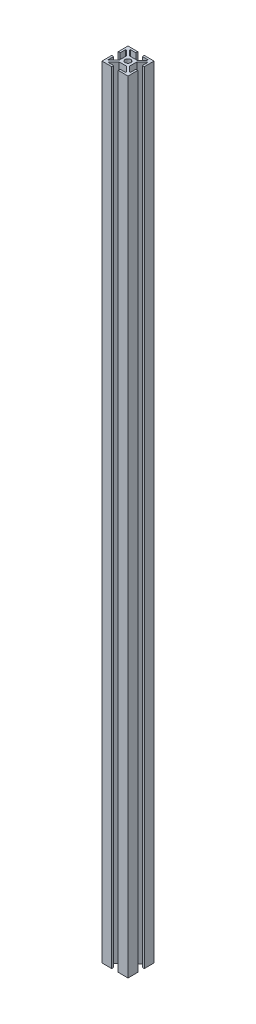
ISO-10303-21;
HEADER;
FILE_DESCRIPTION(('STEP AP214'),'2;1');
FILE_NAME('part.step','',(''),(''),'','','');
FILE_SCHEMA(('AUTOMOTIVE_DESIGN { 1 0 10303 214 1 1 1 1 }'));
ENDSEC;
DATA;
#1=APPLICATION_CONTEXT('core data for automotive mechanical design processes');
#2=APPLICATION_PROTOCOL_DEFINITION('international standard','automotive_design',2000,#1);
#3=PRODUCT_CONTEXT('',#1,'mechanical');
#4=PRODUCT('Part','Part','',(#3));
#5=PRODUCT_RELATED_PRODUCT_CATEGORY('part','',(#4));
#6=PRODUCT_DEFINITION_FORMATION('','',#4);
#7=PRODUCT_DEFINITION_CONTEXT('part definition',#1,'design');
#8=PRODUCT_DEFINITION('design','',#6,#7);
#9=PRODUCT_DEFINITION_SHAPE('','',#8);
#10=(LENGTH_UNIT() NAMED_UNIT(*) SI_UNIT(.MILLI.,.METRE.));
#11=(NAMED_UNIT(*) PLANE_ANGLE_UNIT() SI_UNIT($,.RADIAN.));
#12=(NAMED_UNIT(*) SI_UNIT($,.STERADIAN.) SOLID_ANGLE_UNIT());
#13=UNCERTAINTY_MEASURE_WITH_UNIT(LENGTH_MEASURE(1.E-05),#10,'distance_accuracy_value','');
#14=(GEOMETRIC_REPRESENTATION_CONTEXT(3) GLOBAL_UNCERTAINTY_ASSIGNED_CONTEXT((#13)) GLOBAL_UNIT_ASSIGNED_CONTEXT((#10,
#11,#12)) REPRESENTATION_CONTEXT('',''));
#15=CARTESIAN_POINT('',(0.,0.,0.));
#16=DIRECTION('',(0.,0.,1.));
#17=DIRECTION('',(1.,0.,0.));
#18=AXIS2_PLACEMENT_3D('',#15,#16,#17);
#19=CARTESIAN_POINT('',(0.,600.,0.));
#20=DIRECTION('',(0.,-1.,0.));
#21=DIRECTION('',(0.,0.,-1.));
#22=AXIS2_PLACEMENT_3D('',#19,#20,#21);
#23=PLANE('',#22);
#24=DIRECTION('',(0.,0.,1.));
#25=VECTOR('',#24,1.);
#26=CARTESIAN_POINT('',(-10.,600.,-10.));
#27=LINE('',#26,#25);
#28=CARTESIAN_POINT('',(-10.,600.,-10.));
#29=VERTEX_POINT('',#28);
#30=CARTESIAN_POINT('',(-10.,600.,-2.49999999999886));
#31=VERTEX_POINT('',#30);
#32=EDGE_CURVE('E437',#29,#31,#27,.T.);
#33=ORIENTED_EDGE('',*,*,#32,.T.);
#34=DIRECTION('',(1.,0.,0.));
#35=VECTOR('',#34,1.);
#36=CARTESIAN_POINT('',(-8.49999999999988,600.,-2.49999999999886));
#37=LINE('',#36,#35);
#38=CARTESIAN_POINT('',(-8.49999999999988,600.,-2.49999999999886));
#39=VERTEX_POINT('',#38);
#40=EDGE_CURVE('E205',#31,#39,#37,.T.);
#41=ORIENTED_EDGE('',*,*,#40,.T.);
#42=DIRECTION('',(1.87350135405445E-13,0.,-1.));
#43=VECTOR('',#42,1.);
#44=CARTESIAN_POINT('',(-8.49999999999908,600.,-6.75));
#45=LINE('',#44,#43);
#46=CARTESIAN_POINT('',(-8.49999999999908,600.,-6.75));
#47=VERTEX_POINT('',#46);
#48=EDGE_CURVE('E560',#39,#47,#45,.T.);
#49=ORIENTED_EDGE('',*,*,#48,.T.);
#50=DIRECTION('',(1.,0.,0.));
#51=VECTOR('',#50,1.);
#52=CARTESIAN_POINT('',(-7.84616907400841,600.,-6.75));
#53=LINE('',#52,#51);
#54=CARTESIAN_POINT('',(-7.84616907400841,600.,-6.75));
#55=VERTEX_POINT('',#54);
#56=EDGE_CURVE('E579',#47,#55,#53,.T.);
#57=ORIENTED_EDGE('',*,*,#56,.T.);
#58=DIRECTION('',(0.707106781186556,0.,0.707106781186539));
#59=VECTOR('',#58,1.);
#60=CARTESIAN_POINT('',(-4.00000000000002,600.,-2.9038309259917));
#61=LINE('',#60,#59);
#62=CARTESIAN_POINT('',(-4.00000000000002,600.,-2.9038309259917));
#63=VERTEX_POINT('',#62);
#64=EDGE_CURVE('E576',#55,#63,#61,.T.);
#65=ORIENTED_EDGE('',*,*,#64,.T.);
#66=DIRECTION('',(0.,0.,1.));
#67=VECTOR('',#66,1.);
#68=CARTESIAN_POINT('',(-4.00000000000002,600.,-2.9038309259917));
#69=LINE('',#68,#67);
#70=CARTESIAN_POINT('',(-4.00000000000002,600.,2.9038309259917));
#71=VERTEX_POINT('',#70);
#72=EDGE_CURVE('E578',#63,#71,#69,.T.);
#73=ORIENTED_EDGE('',*,*,#72,.T.);
#74=DIRECTION('',(-0.707106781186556,0.,0.707106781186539));
#75=VECTOR('',#74,1.);
#76=CARTESIAN_POINT('',(-4.00000000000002,600.,2.9038309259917));
#77=LINE('',#76,#75);
#78=CARTESIAN_POINT('',(-7.84616907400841,600.,6.75));
#79=VERTEX_POINT('',#78);
#80=EDGE_CURVE('E581',#71,#79,#77,.T.);
#81=ORIENTED_EDGE('',*,*,#80,.T.);
#82=DIRECTION('',(-1.,0.,0.));
#83=VECTOR('',#82,1.);
#84=CARTESIAN_POINT('',(-7.84616907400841,600.,6.75));
#85=LINE('',#84,#83);
#86=CARTESIAN_POINT('',(-8.49999999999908,600.,6.75));
#87=VERTEX_POINT('',#86);
#88=EDGE_CURVE('E587',#79,#87,#85,.T.);
#89=ORIENTED_EDGE('',*,*,#88,.T.);
#90=DIRECTION('',(-1.87350135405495E-13,0.,-1.));
#91=VECTOR('',#90,1.);
#92=CARTESIAN_POINT('',(-8.49999999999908,600.,6.75));
#93=LINE('',#92,#91);
#94=CARTESIAN_POINT('',(-8.49999999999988,600.,2.5));
#95=VERTEX_POINT('',#94);
#96=EDGE_CURVE('E589',#87,#95,#93,.T.);
#97=ORIENTED_EDGE('',*,*,#96,.T.);
#98=DIRECTION('',(-1.,0.,0.));
#99=VECTOR('',#98,1.);
#100=CARTESIAN_POINT('',(-8.49999999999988,600.,2.5));
#101=LINE('',#100,#99);
#102=CARTESIAN_POINT('',(-10.,600.,2.5));
#103=VERTEX_POINT('',#102);
#104=EDGE_CURVE('E591',#95,#103,#101,.T.);
#105=ORIENTED_EDGE('',*,*,#104,.T.);
#106=DIRECTION('',(0.,0.,1.));
#107=VECTOR('',#106,1.);
#108=CARTESIAN_POINT('',(-10.,600.,2.5));
#109=LINE('',#108,#107);
#110=CARTESIAN_POINT('',(-10.,600.,10.));
#111=VERTEX_POINT('',#110);
#112=EDGE_CURVE('E593',#103,#111,#109,.T.);
#113=ORIENTED_EDGE('',*,*,#112,.T.);
#114=DIRECTION('',(1.,0.,-6.06459327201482E-13));
#115=VECTOR('',#114,1.);
#116=CARTESIAN_POINT('',(-10.,600.,10.));
#117=LINE('',#116,#115);
#118=CARTESIAN_POINT('',(-2.49999999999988,600.,9.99999999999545));
#119=VERTEX_POINT('',#118);
#120=EDGE_CURVE('E595',#111,#119,#117,.T.);
#121=ORIENTED_EDGE('',*,*,#120,.T.);
#122=DIRECTION('',(0.,0.,-1.));
#123=VECTOR('',#122,1.);
#124=CARTESIAN_POINT('',(-2.49999999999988,600.,9.99999999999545));
#125=LINE('',#124,#123);
#126=CARTESIAN_POINT('',(-2.49999999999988,600.,8.49999999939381));
#127=VERTEX_POINT('',#126);
#128=EDGE_CURVE('E597',#119,#127,#125,.T.);
#129=ORIENTED_EDGE('',*,*,#128,.T.);
#130=DIRECTION('',(-1.,0.,0.));
#131=VECTOR('',#130,1.);
#132=CARTESIAN_POINT('',(-2.49999999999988,600.,8.49999999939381));
#133=LINE('',#132,#131);
#134=CARTESIAN_POINT('',(-6.75000000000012,600.,8.49999999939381));
#135=VERTEX_POINT('',#134);
#136=EDGE_CURVE('E599',#127,#135,#133,.T.);
#137=ORIENTED_EDGE('',*,*,#136,.T.);
#138=DIRECTION('',(4.9623445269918E-12,0.,-1.));
#139=VECTOR('',#138,1.);
#140=CARTESIAN_POINT('',(-6.74999999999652,600.,7.7751512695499));
#141=LINE('',#140,#139);
#142=CARTESIAN_POINT('',(-6.74999999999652,600.,7.7751512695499));
#143=VERTEX_POINT('',#142);
#144=EDGE_CURVE('E601',#135,#143,#141,.T.);
#145=ORIENTED_EDGE('',*,*,#144,.T.);
#146=DIRECTION('',(0.707106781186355,0.,-0.70710678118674));
#147=VECTOR('',#146,1.);
#148=CARTESIAN_POINT('',(-2.97484873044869,600.,4.));
#149=LINE('',#148,#147);
#150=CARTESIAN_POINT('',(-2.97484873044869,600.,4.));
#151=VERTEX_POINT('',#150);
#152=EDGE_CURVE('E603',#143,#151,#149,.T.);
#153=ORIENTED_EDGE('',*,*,#152,.T.);
#154=DIRECTION('',(1.,0.,0.));
#155=VECTOR('',#154,1.);
#156=CARTESIAN_POINT('',(-2.97484873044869,600.,4.));
#157=LINE('',#156,#155);
#158=CARTESIAN_POINT('',(2.97484873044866,600.,4.));
#159=VERTEX_POINT('',#158);
#160=EDGE_CURVE('E605',#151,#159,#157,.T.);
#161=ORIENTED_EDGE('',*,*,#160,.T.);
#162=DIRECTION('',(0.707106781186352,0.,0.707106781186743));
#163=VECTOR('',#162,1.);
#164=CARTESIAN_POINT('',(2.97484873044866,600.,4.));
#165=LINE('',#164,#163);
#166=CARTESIAN_POINT('',(6.74999999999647,600.,7.7751512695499));
#167=VERTEX_POINT('',#166);
#168=EDGE_CURVE('E607',#159,#167,#165,.T.);
#169=ORIENTED_EDGE('',*,*,#168,.T.);
#170=DIRECTION('',(5.03892761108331E-12,0.,1.));
#171=VECTOR('',#170,1.);
#172=CARTESIAN_POINT('',(6.74999999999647,600.,7.7751512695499));
#173=LINE('',#172,#171);
#174=CARTESIAN_POINT('',(6.75000000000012,600.,8.49999999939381));
#175=VERTEX_POINT('',#174);
#176=EDGE_CURVE('E609',#167,#175,#173,.T.);
#177=ORIENTED_EDGE('',*,*,#176,.T.);
#178=DIRECTION('',(-1.,0.,0.));
#179=VECTOR('',#178,1.);
#180=CARTESIAN_POINT('',(2.50000000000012,600.,8.49999999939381));
#181=LINE('',#180,#179);
#182=CARTESIAN_POINT('',(2.50000000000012,600.,8.49999999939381));
#183=VERTEX_POINT('',#182);
#184=EDGE_CURVE('E611',#175,#183,#181,.T.);
#185=ORIENTED_EDGE('',*,*,#184,.T.);
#186=DIRECTION('',(0.,0.,1.));
#187=VECTOR('',#186,1.);
#188=CARTESIAN_POINT('',(2.50000000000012,600.,9.99999999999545));
#189=LINE('',#188,#187);
#190=CARTESIAN_POINT('',(2.50000000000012,600.,9.99999999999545));
#191=VERTEX_POINT('',#190);
#192=EDGE_CURVE('E613',#183,#191,#189,.T.);
#193=ORIENTED_EDGE('',*,*,#192,.T.);
#194=DIRECTION('',(1.,0.,6.06459327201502E-13));
#195=VECTOR('',#194,1.);
#196=CARTESIAN_POINT('',(2.50000000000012,600.,9.99999999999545));
#197=LINE('',#196,#195);
#198=CARTESIAN_POINT('',(10.,600.,10.));
#199=VERTEX_POINT('',#198);
#200=EDGE_CURVE('E615',#191,#199,#197,.T.);
#201=ORIENTED_EDGE('',*,*,#200,.T.);
#202=DIRECTION('',(0.,0.,-1.));
#203=VECTOR('',#202,1.);
#204=CARTESIAN_POINT('',(10.,600.,2.5));
#205=LINE('',#204,#203);
#206=CARTESIAN_POINT('',(10.,600.,2.5));
#207=VERTEX_POINT('',#206);
#208=EDGE_CURVE('E617',#199,#207,#205,.T.);
#209=ORIENTED_EDGE('',*,*,#208,.T.);
#210=DIRECTION('',(-1.,0.,0.));
#211=VECTOR('',#210,1.);
#212=CARTESIAN_POINT('',(8.50000000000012,600.,2.5));
#213=LINE('',#212,#211);
#214=CARTESIAN_POINT('',(8.50000000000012,600.,2.5));
#215=VERTEX_POINT('',#214);
#216=EDGE_CURVE('E619',#207,#215,#213,.T.);
#217=ORIENTED_EDGE('',*,*,#216,.T.);
#218=DIRECTION('',(-2.55106393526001E-13,0.,1.));
#219=VECTOR('',#218,1.);
#220=CARTESIAN_POINT('',(8.49999999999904,600.,6.75));
#221=LINE('',#220,#219);
#222=CARTESIAN_POINT('',(8.49999999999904,600.,6.75));
#223=VERTEX_POINT('',#222);
#224=EDGE_CURVE('E621',#215,#223,#221,.T.);
#225=ORIENTED_EDGE('',*,*,#224,.T.);
#226=DIRECTION('',(-1.,0.,0.));
#227=VECTOR('',#226,1.);
#228=CARTESIAN_POINT('',(7.84616907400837,600.,6.75));
#229=LINE('',#228,#227);
#230=CARTESIAN_POINT('',(7.84616907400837,600.,6.75));
#231=VERTEX_POINT('',#230);
#232=EDGE_CURVE('E623',#223,#231,#229,.T.);
#233=ORIENTED_EDGE('',*,*,#232,.T.);
#234=DIRECTION('',(-0.707106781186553,0.,-0.707106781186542));
#235=VECTOR('',#234,1.);
#236=CARTESIAN_POINT('',(4.,600.,2.9038309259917));
#237=LINE('',#236,#235);
#238=CARTESIAN_POINT('',(4.,600.,2.9038309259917));
#239=VERTEX_POINT('',#238);
#240=EDGE_CURVE('E625',#231,#239,#237,.T.);
#241=ORIENTED_EDGE('',*,*,#240,.T.);
#242=DIRECTION('',(0.,0.,-1.));
#243=VECTOR('',#242,1.);
#244=CARTESIAN_POINT('',(4.,600.,-2.9038309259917));
#245=LINE('',#244,#243);
#246=CARTESIAN_POINT('',(4.,600.,-2.9038309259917));
#247=VERTEX_POINT('',#246);
#248=EDGE_CURVE('E627',#239,#247,#245,.T.);
#249=ORIENTED_EDGE('',*,*,#248,.T.);
#250=DIRECTION('',(0.707106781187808,0.,-0.707106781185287));
#251=VECTOR('',#250,1.);
#252=CARTESIAN_POINT('',(4.,600.,-2.9038309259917));
#253=LINE('',#252,#251);
#254=CARTESIAN_POINT('',(7.84616907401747,600.,-6.74999999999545));
#255=VERTEX_POINT('',#254);
#256=EDGE_CURVE('E629',#247,#255,#253,.T.);
#257=ORIENTED_EDGE('',*,*,#256,.T.);
#258=DIRECTION('',(1.,0.,-6.95660724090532E-12));
#259=VECTOR('',#258,1.);
#260=CARTESIAN_POINT('',(7.84616907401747,600.,-6.74999999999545));
#261=LINE('',#260,#259);
#262=CARTESIAN_POINT('',(8.49999999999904,600.,-6.75));
#263=VERTEX_POINT('',#262);
#264=EDGE_CURVE('E631',#255,#263,#261,.T.);
#265=ORIENTED_EDGE('',*,*,#264,.T.);
#266=DIRECTION('',(2.55106393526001E-13,0.,1.));
#267=VECTOR('',#266,1.);
#268=CARTESIAN_POINT('',(8.49999999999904,600.,-6.75));
#269=LINE('',#268,#267);
#270=CARTESIAN_POINT('',(8.50000000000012,600.,-2.5));
#271=VERTEX_POINT('',#270);
#272=EDGE_CURVE('E633',#263,#271,#269,.T.);
#273=ORIENTED_EDGE('',*,*,#272,.T.);
#274=DIRECTION('',(1.,0.,0.));
#275=VECTOR('',#274,1.);
#276=CARTESIAN_POINT('',(8.50000000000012,600.,-2.5));
#277=LINE('',#276,#275);
#278=CARTESIAN_POINT('',(10.,600.,-2.5));
#279=VERTEX_POINT('',#278);
#280=EDGE_CURVE('E635',#271,#279,#277,.T.);
#281=ORIENTED_EDGE('',*,*,#280,.T.);
#282=DIRECTION('',(0.,0.,-1.));
#283=VECTOR('',#282,1.);
#284=CARTESIAN_POINT('',(10.,600.,-10.));
#285=LINE('',#284,#283);
#286=CARTESIAN_POINT('',(10.,600.,-10.));
#287=VERTEX_POINT('',#286);
#288=EDGE_CURVE('E637',#279,#287,#285,.T.);
#289=ORIENTED_EDGE('',*,*,#288,.T.);
#290=DIRECTION('',(-1.,0.,6.06228030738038E-13));
#291=VECTOR('',#290,1.);
#292=CARTESIAN_POINT('',(2.50000000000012,600.,-9.99999999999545));
#293=LINE('',#292,#291);
#294=CARTESIAN_POINT('',(2.50000000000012,600.,-9.99999999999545));
#295=VERTEX_POINT('',#294);
#296=EDGE_CURVE('E639',#287,#295,#293,.T.);
#297=ORIENTED_EDGE('',*,*,#296,.T.);
#298=DIRECTION('',(0.,0.,1.));
#299=VECTOR('',#298,1.);
#300=CARTESIAN_POINT('',(2.50000000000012,600.,-9.99999999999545));
#301=LINE('',#300,#299);
#302=CARTESIAN_POINT('',(2.50000000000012,600.,-8.49999999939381));
#303=VERTEX_POINT('',#302);
#304=EDGE_CURVE('E641',#295,#303,#301,.T.);
#305=ORIENTED_EDGE('',*,*,#304,.T.);
#306=DIRECTION('',(1.,0.,0.));
#307=VECTOR('',#306,1.);
#308=CARTESIAN_POINT('',(2.50000000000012,600.,-8.49999999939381));
#309=LINE('',#308,#307);
#310=CARTESIAN_POINT('',(6.75000000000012,600.,-8.49999999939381));
#311=VERTEX_POINT('',#310);
#312=EDGE_CURVE('E643',#303,#311,#309,.T.);
#313=ORIENTED_EDGE('',*,*,#312,.T.);
#314=DIRECTION('',(-1.68722107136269E-13,0.,1.));
#315=VECTOR('',#314,1.);
#316=CARTESIAN_POINT('',(6.75,600.,-7.77515126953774));
#317=LINE('',#316,#315);
#318=CARTESIAN_POINT('',(6.75,600.,-7.77515126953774));
#319=VERTEX_POINT('',#318);
#320=EDGE_CURVE('E645',#311,#319,#317,.T.);
#321=ORIENTED_EDGE('',*,*,#320,.T.);
#322=DIRECTION('',(-0.707106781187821,0.,0.707106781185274));
#323=VECTOR('',#322,1.);
#324=CARTESIAN_POINT('',(2.97484873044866,600.,-4.));
#325=LINE('',#324,#323);
#326=CARTESIAN_POINT('',(2.97484873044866,600.,-4.));
#327=VERTEX_POINT('',#326);
#328=EDGE_CURVE('E647',#319,#327,#325,.T.);
#329=ORIENTED_EDGE('',*,*,#328,.T.);
#330=DIRECTION('',(-1.,0.,0.));
#331=VECTOR('',#330,1.);
#332=CARTESIAN_POINT('',(-2.97484873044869,600.,-4.));
#333=LINE('',#332,#331);
#334=CARTESIAN_POINT('',(-2.97484873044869,600.,-4.));
#335=VERTEX_POINT('',#334);
#336=EDGE_CURVE('E649',#327,#335,#333,.T.);
#337=ORIENTED_EDGE('',*,*,#336,.T.);
#338=DIRECTION('',(-0.707106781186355,0.,-0.70710678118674));
#339=VECTOR('',#338,1.);
#340=CARTESIAN_POINT('',(-2.97484873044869,600.,-4.));
#341=LINE('',#340,#339);
#342=CARTESIAN_POINT('',(-6.74999999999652,600.,-7.7751512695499));
#343=VERTEX_POINT('',#342);
#344=EDGE_CURVE('E651',#335,#343,#341,.T.);
#345=ORIENTED_EDGE('',*,*,#344,.T.);
#346=DIRECTION('',(-4.9623445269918E-12,0.,-1.));
#347=VECTOR('',#346,1.);
#348=CARTESIAN_POINT('',(-6.74999999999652,600.,-7.7751512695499));
#349=LINE('',#348,#347);
#350=CARTESIAN_POINT('',(-6.75000000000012,600.,-8.49999999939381));
#351=VERTEX_POINT('',#350);
#352=EDGE_CURVE('E332',#343,#351,#349,.T.);
#353=ORIENTED_EDGE('',*,*,#352,.T.);
#354=DIRECTION('',(1.,0.,0.));
#355=VECTOR('',#354,1.);
#356=CARTESIAN_POINT('',(-2.49999999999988,600.,-8.49999999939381));
#357=LINE('',#356,#355);
#358=CARTESIAN_POINT('',(-2.49999999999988,600.,-8.49999999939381));
#359=VERTEX_POINT('',#358);
#360=EDGE_CURVE('E326',#351,#359,#357,.T.);
#361=ORIENTED_EDGE('',*,*,#360,.T.);
#362=DIRECTION('',(0.,0.,-1.));
#363=VECTOR('',#362,1.);
#364=CARTESIAN_POINT('',(-2.49999999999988,600.,-10.));
#365=LINE('',#364,#363);
#366=CARTESIAN_POINT('',(-2.49999999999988,600.,-10.));
#367=VERTEX_POINT('',#366);
#368=EDGE_CURVE('E330',#359,#367,#365,.T.);
#369=ORIENTED_EDGE('',*,*,#368,.T.);
#370=DIRECTION('',(-1.,0.,0.));
#371=VECTOR('',#370,1.);
#372=CARTESIAN_POINT('',(-10.,600.,-10.));
#373=LINE('',#372,#371);
#374=EDGE_CURVE('E54',#367,#29,#373,.T.);
#375=ORIENTED_EDGE('',*,*,#374,.T.);
#376=EDGE_LOOP('',(#33,#41,#49,#57,#65,#73,#81,#89,#97,#105,#113,#121,#129,#137,#145,#153,#161,
#169,#177,#185,#193,#201,#209,#217,#225,#233,#241,#249,#257,#265,#273,#281,#289,#297,#305,#313,
#321,#329,#337,#345,#353,#361,#369,#375));
#377=FACE_BOUND('',#376,.T.);
#378=CARTESIAN_POINT('',(0.,600.,0.));
#379=DIRECTION('',(0.,1.,0.));
#380=DIRECTION('',(0.,0.,1.));
#381=AXIS2_PLACEMENT_3D('',#378,#379,#380);
#382=CIRCLE('',#381,2.15);
#383=CARTESIAN_POINT('',(0.,600.,2.15));
#384=VERTEX_POINT('',#383);
#385=EDGE_CURVE('E354',#384,#384,#382,.T.);
#386=ORIENTED_EDGE('',*,*,#385,.F.);
#387=EDGE_LOOP('',(#386));
#388=FACE_BOUND('',#387,.T.);
#389=ADVANCED_FACE('F37',(#377,#388),#23,.F.);
#390=CARTESIAN_POINT('',(0.,0.,0.));
#391=DIRECTION('',(0.,-1.,0.));
#392=DIRECTION('',(0.,0.,-1.));
#393=AXIS2_PLACEMENT_3D('',#390,#391,#392);
#394=PLANE('',#393);
#395=DIRECTION('',(0.,0.,1.));
#396=VECTOR('',#395,1.);
#397=CARTESIAN_POINT('',(-10.,0.,-10.));
#398=LINE('',#397,#396);
#399=CARTESIAN_POINT('',(-10.,0.,-10.));
#400=VERTEX_POINT('',#399);
#401=CARTESIAN_POINT('',(-10.,0.,-2.49999999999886));
#402=VERTEX_POINT('',#401);
#403=EDGE_CURVE('E350',#400,#402,#398,.T.);
#404=ORIENTED_EDGE('',*,*,#403,.F.);
#405=DIRECTION('',(-1.,0.,0.));
#406=VECTOR('',#405,1.);
#407=CARTESIAN_POINT('',(-10.,0.,-10.));
#408=LINE('',#407,#406);
#409=CARTESIAN_POINT('',(-2.49999999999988,0.,-10.));
#410=VERTEX_POINT('',#409);
#411=EDGE_CURVE('E197',#410,#400,#408,.T.);
#412=ORIENTED_EDGE('',*,*,#411,.F.);
#413=DIRECTION('',(0.,0.,-1.));
#414=VECTOR('',#413,1.);
#415=CARTESIAN_POINT('',(-2.49999999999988,0.,-10.));
#416=LINE('',#415,#414);
#417=CARTESIAN_POINT('',(-2.49999999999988,0.,-8.49999999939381));
#418=VERTEX_POINT('',#417);
#419=EDGE_CURVE('E191',#418,#410,#416,.T.);
#420=ORIENTED_EDGE('',*,*,#419,.F.);
#421=DIRECTION('',(1.,0.,0.));
#422=VECTOR('',#421,1.);
#423=CARTESIAN_POINT('',(-2.49999999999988,0.,-8.49999999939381));
#424=LINE('',#423,#422);
#425=CARTESIAN_POINT('',(-6.75000000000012,0.,-8.49999999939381));
#426=VERTEX_POINT('',#425);
#427=EDGE_CURVE('E340',#426,#418,#424,.T.);
#428=ORIENTED_EDGE('',*,*,#427,.F.);
#429=DIRECTION('',(-4.9623445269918E-12,0.,-1.));
#430=VECTOR('',#429,1.);
#431=CARTESIAN_POINT('',(-6.74999999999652,0.,-7.7751512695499));
#432=LINE('',#431,#430);
#433=CARTESIAN_POINT('',(-6.74999999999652,0.,-7.7751512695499));
#434=VERTEX_POINT('',#433);
#435=EDGE_CURVE('E432',#434,#426,#432,.T.);
#436=ORIENTED_EDGE('',*,*,#435,.F.);
#437=DIRECTION('',(-0.707106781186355,0.,-0.70710678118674));
#438=VECTOR('',#437,1.);
#439=CARTESIAN_POINT('',(-2.97484873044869,0.,-4.));
#440=LINE('',#439,#438);
#441=CARTESIAN_POINT('',(-2.97484873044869,0.,-4.));
#442=VERTEX_POINT('',#441);
#443=EDGE_CURVE('E430',#442,#434,#440,.T.);
#444=ORIENTED_EDGE('',*,*,#443,.F.);
#445=DIRECTION('',(-1.,0.,0.));
#446=VECTOR('',#445,1.);
#447=CARTESIAN_POINT('',(-2.97484873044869,0.,-4.));
#448=LINE('',#447,#446);
#449=CARTESIAN_POINT('',(2.97484873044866,0.,-4.));
#450=VERTEX_POINT('',#449);
#451=EDGE_CURVE('E428',#450,#442,#448,.T.);
#452=ORIENTED_EDGE('',*,*,#451,.F.);
#453=DIRECTION('',(-0.707106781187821,0.,0.707106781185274));
#454=VECTOR('',#453,1.);
#455=CARTESIAN_POINT('',(2.97484873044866,0.,-4.));
#456=LINE('',#455,#454);
#457=CARTESIAN_POINT('',(6.75,0.,-7.77515126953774));
#458=VERTEX_POINT('',#457);
#459=EDGE_CURVE('E426',#458,#450,#456,.T.);
#460=ORIENTED_EDGE('',*,*,#459,.F.);
#461=DIRECTION('',(-1.68722107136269E-13,0.,1.));
#462=VECTOR('',#461,1.);
#463=CARTESIAN_POINT('',(6.75,0.,-7.77515126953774));
#464=LINE('',#463,#462);
#465=CARTESIAN_POINT('',(6.75000000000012,0.,-8.49999999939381));
#466=VERTEX_POINT('',#465);
#467=EDGE_CURVE('E424',#466,#458,#464,.T.);
#468=ORIENTED_EDGE('',*,*,#467,.F.);
#469=DIRECTION('',(1.,0.,0.));
#470=VECTOR('',#469,1.);
#471=CARTESIAN_POINT('',(2.50000000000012,0.,-8.49999999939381));
#472=LINE('',#471,#470);
#473=CARTESIAN_POINT('',(2.50000000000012,0.,-8.49999999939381));
#474=VERTEX_POINT('',#473);
#475=EDGE_CURVE('E422',#474,#466,#472,.T.);
#476=ORIENTED_EDGE('',*,*,#475,.F.);
#477=DIRECTION('',(0.,0.,1.));
#478=VECTOR('',#477,1.);
#479=CARTESIAN_POINT('',(2.50000000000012,0.,-9.99999999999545));
#480=LINE('',#479,#478);
#481=CARTESIAN_POINT('',(2.50000000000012,0.,-9.99999999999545));
#482=VERTEX_POINT('',#481);
#483=EDGE_CURVE('E420',#482,#474,#480,.T.);
#484=ORIENTED_EDGE('',*,*,#483,.F.);
#485=DIRECTION('',(-1.,0.,6.06228030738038E-13));
#486=VECTOR('',#485,1.);
#487=CARTESIAN_POINT('',(2.50000000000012,0.,-9.99999999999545));
#488=LINE('',#487,#486);
#489=CARTESIAN_POINT('',(10.,0.,-10.));
#490=VERTEX_POINT('',#489);
#491=EDGE_CURVE('E418',#490,#482,#488,.T.);
#492=ORIENTED_EDGE('',*,*,#491,.F.);
#493=DIRECTION('',(0.,0.,-1.));
#494=VECTOR('',#493,1.);
#495=CARTESIAN_POINT('',(10.,0.,-10.));
#496=LINE('',#495,#494);
#497=CARTESIAN_POINT('',(10.,0.,-2.5));
#498=VERTEX_POINT('',#497);
#499=EDGE_CURVE('E416',#498,#490,#496,.T.);
#500=ORIENTED_EDGE('',*,*,#499,.F.);
#501=DIRECTION('',(1.,0.,0.));
#502=VECTOR('',#501,1.);
#503=CARTESIAN_POINT('',(8.50000000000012,0.,-2.5));
#504=LINE('',#503,#502);
#505=CARTESIAN_POINT('',(8.50000000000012,0.,-2.5));
#506=VERTEX_POINT('',#505);
#507=EDGE_CURVE('E414',#506,#498,#504,.T.);
#508=ORIENTED_EDGE('',*,*,#507,.F.);
#509=DIRECTION('',(2.55106393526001E-13,0.,1.));
#510=VECTOR('',#509,1.);
#511=CARTESIAN_POINT('',(8.49999999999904,0.,-6.75));
#512=LINE('',#511,#510);
#513=CARTESIAN_POINT('',(8.49999999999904,0.,-6.75));
#514=VERTEX_POINT('',#513);
#515=EDGE_CURVE('E412',#514,#506,#512,.T.);
#516=ORIENTED_EDGE('',*,*,#515,.F.);
#517=DIRECTION('',(1.,0.,-6.95660724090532E-12));
#518=VECTOR('',#517,1.);
#519=CARTESIAN_POINT('',(7.84616907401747,0.,-6.74999999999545));
#520=LINE('',#519,#518);
#521=CARTESIAN_POINT('',(7.84616907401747,0.,-6.74999999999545));
#522=VERTEX_POINT('',#521);
#523=EDGE_CURVE('E410',#522,#514,#520,.T.);
#524=ORIENTED_EDGE('',*,*,#523,.F.);
#525=DIRECTION('',(0.707106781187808,0.,-0.707106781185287));
#526=VECTOR('',#525,1.);
#527=CARTESIAN_POINT('',(4.,0.,-2.9038309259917));
#528=LINE('',#527,#526);
#529=CARTESIAN_POINT('',(4.,0.,-2.9038309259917));
#530=VERTEX_POINT('',#529);
#531=EDGE_CURVE('E408',#530,#522,#528,.T.);
#532=ORIENTED_EDGE('',*,*,#531,.F.);
#533=DIRECTION('',(0.,0.,-1.));
#534=VECTOR('',#533,1.);
#535=CARTESIAN_POINT('',(4.,0.,-2.9038309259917));
#536=LINE('',#535,#534);
#537=CARTESIAN_POINT('',(4.,0.,2.9038309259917));
#538=VERTEX_POINT('',#537);
#539=EDGE_CURVE('E406',#538,#530,#536,.T.);
#540=ORIENTED_EDGE('',*,*,#539,.F.);
#541=DIRECTION('',(-0.707106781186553,0.,-0.707106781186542));
#542=VECTOR('',#541,1.);
#543=CARTESIAN_POINT('',(4.,0.,2.9038309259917));
#544=LINE('',#543,#542);
#545=CARTESIAN_POINT('',(7.84616907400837,0.,6.75));
#546=VERTEX_POINT('',#545);
#547=EDGE_CURVE('E404',#546,#538,#544,.T.);
#548=ORIENTED_EDGE('',*,*,#547,.F.);
#549=DIRECTION('',(-1.,0.,0.));
#550=VECTOR('',#549,1.);
#551=CARTESIAN_POINT('',(7.84616907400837,0.,6.75));
#552=LINE('',#551,#550);
#553=CARTESIAN_POINT('',(8.49999999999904,0.,6.75));
#554=VERTEX_POINT('',#553);
#555=EDGE_CURVE('E402',#554,#546,#552,.T.);
#556=ORIENTED_EDGE('',*,*,#555,.F.);
#557=DIRECTION('',(-2.55106393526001E-13,0.,1.));
#558=VECTOR('',#557,1.);
#559=CARTESIAN_POINT('',(8.49999999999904,0.,6.75));
#560=LINE('',#559,#558);
#561=CARTESIAN_POINT('',(8.50000000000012,0.,2.5));
#562=VERTEX_POINT('',#561);
#563=EDGE_CURVE('E400',#562,#554,#560,.T.);
#564=ORIENTED_EDGE('',*,*,#563,.F.);
#565=DIRECTION('',(-1.,0.,0.));
#566=VECTOR('',#565,1.);
#567=CARTESIAN_POINT('',(8.50000000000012,0.,2.5));
#568=LINE('',#567,#566);
#569=CARTESIAN_POINT('',(10.,0.,2.5));
#570=VERTEX_POINT('',#569);
#571=EDGE_CURVE('E398',#570,#562,#568,.T.);
#572=ORIENTED_EDGE('',*,*,#571,.F.);
#573=DIRECTION('',(0.,0.,-1.));
#574=VECTOR('',#573,1.);
#575=CARTESIAN_POINT('',(10.,0.,2.5));
#576=LINE('',#575,#574);
#577=CARTESIAN_POINT('',(10.,0.,10.));
#578=VERTEX_POINT('',#577);
#579=EDGE_CURVE('E396',#578,#570,#576,.T.);
#580=ORIENTED_EDGE('',*,*,#579,.F.);
#581=DIRECTION('',(1.,0.,6.06459327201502E-13));
#582=VECTOR('',#581,1.);
#583=CARTESIAN_POINT('',(2.50000000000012,0.,9.99999999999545));
#584=LINE('',#583,#582);
#585=CARTESIAN_POINT('',(2.50000000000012,0.,9.99999999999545));
#586=VERTEX_POINT('',#585);
#587=EDGE_CURVE('E394',#586,#578,#584,.T.);
#588=ORIENTED_EDGE('',*,*,#587,.F.);
#589=DIRECTION('',(0.,0.,1.));
#590=VECTOR('',#589,1.);
#591=CARTESIAN_POINT('',(2.50000000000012,0.,9.99999999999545));
#592=LINE('',#591,#590);
#593=CARTESIAN_POINT('',(2.50000000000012,0.,8.49999999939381));
#594=VERTEX_POINT('',#593);
#595=EDGE_CURVE('E392',#594,#586,#592,.T.);
#596=ORIENTED_EDGE('',*,*,#595,.F.);
#597=DIRECTION('',(-1.,0.,0.));
#598=VECTOR('',#597,1.);
#599=CARTESIAN_POINT('',(2.50000000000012,0.,8.49999999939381));
#600=LINE('',#599,#598);
#601=CARTESIAN_POINT('',(6.75000000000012,0.,8.49999999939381));
#602=VERTEX_POINT('',#601);
#603=EDGE_CURVE('E390',#602,#594,#600,.T.);
#604=ORIENTED_EDGE('',*,*,#603,.F.);
#605=DIRECTION('',(5.03892761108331E-12,0.,1.));
#606=VECTOR('',#605,1.);
#607=CARTESIAN_POINT('',(6.74999999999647,0.,7.7751512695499));
#608=LINE('',#607,#606);
#609=CARTESIAN_POINT('',(6.74999999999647,0.,7.7751512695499));
#610=VERTEX_POINT('',#609);
#611=EDGE_CURVE('E388',#610,#602,#608,.T.);
#612=ORIENTED_EDGE('',*,*,#611,.F.);
#613=DIRECTION('',(0.707106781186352,0.,0.707106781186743));
#614=VECTOR('',#613,1.);
#615=CARTESIAN_POINT('',(2.97484873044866,0.,4.));
#616=LINE('',#615,#614);
#617=CARTESIAN_POINT('',(2.97484873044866,0.,4.));
#618=VERTEX_POINT('',#617);
#619=EDGE_CURVE('E386',#618,#610,#616,.T.);
#620=ORIENTED_EDGE('',*,*,#619,.F.);
#621=DIRECTION('',(1.,0.,0.));
#622=VECTOR('',#621,1.);
#623=CARTESIAN_POINT('',(-2.97484873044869,0.,4.));
#624=LINE('',#623,#622);
#625=CARTESIAN_POINT('',(-2.97484873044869,0.,4.));
#626=VERTEX_POINT('',#625);
#627=EDGE_CURVE('E384',#626,#618,#624,.T.);
#628=ORIENTED_EDGE('',*,*,#627,.F.);
#629=DIRECTION('',(0.707106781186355,0.,-0.70710678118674));
#630=VECTOR('',#629,1.);
#631=CARTESIAN_POINT('',(-2.97484873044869,0.,4.));
#632=LINE('',#631,#630);
#633=CARTESIAN_POINT('',(-6.74999999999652,0.,7.7751512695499));
#634=VERTEX_POINT('',#633);
#635=EDGE_CURVE('E382',#634,#626,#632,.T.);
#636=ORIENTED_EDGE('',*,*,#635,.F.);
#637=DIRECTION('',(4.9623445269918E-12,0.,-1.));
#638=VECTOR('',#637,1.);
#639=CARTESIAN_POINT('',(-6.74999999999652,0.,7.7751512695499));
#640=LINE('',#639,#638);
#641=CARTESIAN_POINT('',(-6.75000000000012,0.,8.49999999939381));
#642=VERTEX_POINT('',#641);
#643=EDGE_CURVE('E380',#642,#634,#640,.T.);
#644=ORIENTED_EDGE('',*,*,#643,.F.);
#645=DIRECTION('',(-1.,0.,0.));
#646=VECTOR('',#645,1.);
#647=CARTESIAN_POINT('',(-2.49999999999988,0.,8.49999999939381));
#648=LINE('',#647,#646);
#649=CARTESIAN_POINT('',(-2.49999999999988,0.,8.49999999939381));
#650=VERTEX_POINT('',#649);
#651=EDGE_CURVE('E378',#650,#642,#648,.T.);
#652=ORIENTED_EDGE('',*,*,#651,.F.);
#653=DIRECTION('',(0.,0.,-1.));
#654=VECTOR('',#653,1.);
#655=CARTESIAN_POINT('',(-2.49999999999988,0.,9.99999999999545));
#656=LINE('',#655,#654);
#657=CARTESIAN_POINT('',(-2.49999999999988,0.,9.99999999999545));
#658=VERTEX_POINT('',#657);
#659=EDGE_CURVE('E376',#658,#650,#656,.T.);
#660=ORIENTED_EDGE('',*,*,#659,.F.);
#661=DIRECTION('',(1.,0.,-6.06459327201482E-13));
#662=VECTOR('',#661,1.);
#663=CARTESIAN_POINT('',(-10.,0.,10.));
#664=LINE('',#663,#662);
#665=CARTESIAN_POINT('',(-10.,0.,10.));
#666=VERTEX_POINT('',#665);
#667=EDGE_CURVE('E374',#666,#658,#664,.T.);
#668=ORIENTED_EDGE('',*,*,#667,.F.);
#669=DIRECTION('',(0.,0.,1.));
#670=VECTOR('',#669,1.);
#671=CARTESIAN_POINT('',(-10.,0.,2.5));
#672=LINE('',#671,#670);
#673=CARTESIAN_POINT('',(-10.,0.,2.5));
#674=VERTEX_POINT('',#673);
#675=EDGE_CURVE('E372',#674,#666,#672,.T.);
#676=ORIENTED_EDGE('',*,*,#675,.F.);
#677=DIRECTION('',(-1.,0.,0.));
#678=VECTOR('',#677,1.);
#679=CARTESIAN_POINT('',(-8.49999999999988,0.,2.5));
#680=LINE('',#679,#678);
#681=CARTESIAN_POINT('',(-8.49999999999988,0.,2.5));
#682=VERTEX_POINT('',#681);
#683=EDGE_CURVE('E370',#682,#674,#680,.T.);
#684=ORIENTED_EDGE('',*,*,#683,.F.);
#685=DIRECTION('',(-1.87350135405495E-13,0.,-1.));
#686=VECTOR('',#685,1.);
#687=CARTESIAN_POINT('',(-8.49999999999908,0.,6.75));
#688=LINE('',#687,#686);
#689=CARTESIAN_POINT('',(-8.49999999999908,0.,6.75));
#690=VERTEX_POINT('',#689);
#691=EDGE_CURVE('E368',#690,#682,#688,.T.);
#692=ORIENTED_EDGE('',*,*,#691,.F.);
#693=DIRECTION('',(-1.,0.,0.));
#694=VECTOR('',#693,1.);
#695=CARTESIAN_POINT('',(-7.84616907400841,0.,6.75));
#696=LINE('',#695,#694);
#697=CARTESIAN_POINT('',(-7.84616907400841,0.,6.75));
#698=VERTEX_POINT('',#697);
#699=EDGE_CURVE('E366',#698,#690,#696,.T.);
#700=ORIENTED_EDGE('',*,*,#699,.F.);
#701=DIRECTION('',(-0.707106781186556,0.,0.707106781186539));
#702=VECTOR('',#701,1.);
#703=CARTESIAN_POINT('',(-4.00000000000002,0.,2.9038309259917));
#704=LINE('',#703,#702);
#705=CARTESIAN_POINT('',(-4.00000000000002,0.,2.9038309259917));
#706=VERTEX_POINT('',#705);
#707=EDGE_CURVE('E364',#706,#698,#704,.T.);
#708=ORIENTED_EDGE('',*,*,#707,.F.);
#709=DIRECTION('',(0.,0.,1.));
#710=VECTOR('',#709,1.);
#711=CARTESIAN_POINT('',(-4.00000000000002,0.,-2.9038309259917));
#712=LINE('',#711,#710);
#713=CARTESIAN_POINT('',(-4.00000000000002,0.,-2.9038309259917));
#714=VERTEX_POINT('',#713);
#715=EDGE_CURVE('E362',#714,#706,#712,.T.);
#716=ORIENTED_EDGE('',*,*,#715,.F.);
#717=DIRECTION('',(0.707106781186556,0.,0.707106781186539));
#718=VECTOR('',#717,1.);
#719=CARTESIAN_POINT('',(-4.00000000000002,0.,-2.9038309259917));
#720=LINE('',#719,#718);
#721=CARTESIAN_POINT('',(-7.84616907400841,0.,-6.75));
#722=VERTEX_POINT('',#721);
#723=EDGE_CURVE('E360',#722,#714,#720,.T.);
#724=ORIENTED_EDGE('',*,*,#723,.F.);
#725=DIRECTION('',(1.,0.,0.));
#726=VECTOR('',#725,1.);
#727=CARTESIAN_POINT('',(-7.84616907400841,0.,-6.75));
#728=LINE('',#727,#726);
#729=CARTESIAN_POINT('',(-8.49999999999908,0.,-6.75));
#730=VERTEX_POINT('',#729);
#731=EDGE_CURVE('E358',#730,#722,#728,.T.);
#732=ORIENTED_EDGE('',*,*,#731,.F.);
#733=DIRECTION('',(1.87350135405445E-13,0.,-1.));
#734=VECTOR('',#733,1.);
#735=CARTESIAN_POINT('',(-8.49999999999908,0.,-6.75));
#736=LINE('',#735,#734);
#737=CARTESIAN_POINT('',(-8.49999999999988,0.,-2.49999999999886));
#738=VERTEX_POINT('',#737);
#739=EDGE_CURVE('E356',#738,#730,#736,.T.);
#740=ORIENTED_EDGE('',*,*,#739,.F.);
#741=DIRECTION('',(1.,0.,0.));
#742=VECTOR('',#741,1.);
#743=CARTESIAN_POINT('',(-8.49999999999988,0.,-2.49999999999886));
#744=LINE('',#743,#742);
#745=EDGE_CURVE('E353',#402,#738,#744,.T.);
#746=ORIENTED_EDGE('',*,*,#745,.F.);
#747=EDGE_LOOP('',(#404,#412,#420,#428,#436,#444,#452,#460,#468,#476,#484,#492,#500,#508,#516,
#524,#532,#540,#548,#556,#564,#572,#580,#588,#596,#604,#612,#620,#628,#636,#644,#652,#660,#668,
#676,#684,#692,#700,#708,#716,#724,#732,#740,#746));
#748=FACE_BOUND('',#747,.T.);
#749=CARTESIAN_POINT('',(0.,0.,0.));
#750=DIRECTION('',(0.,1.,0.));
#751=DIRECTION('',(0.,0.,1.));
#752=AXIS2_PLACEMENT_3D('',#749,#750,#751);
#753=CIRCLE('',#752,2.15);
#754=CARTESIAN_POINT('',(0.,0.,2.15));
#755=VERTEX_POINT('',#754);
#756=EDGE_CURVE('E1308',#755,#755,#753,.T.);
#757=ORIENTED_EDGE('',*,*,#756,.T.);
#758=EDGE_LOOP('',(#757));
#759=FACE_BOUND('',#758,.T.);
#760=ADVANCED_FACE('F564',(#748,#759),#394,.T.);
#761=CARTESIAN_POINT('',(-10.,600.,-10.));
#762=DIRECTION('',(1.,0.,0.));
#763=DIRECTION('',(0.,0.,-1.));
#764=AXIS2_PLACEMENT_3D('',#761,#762,#763);
#765=PLANE('',#764);
#766=ORIENTED_EDGE('',*,*,#403,.T.);
#767=DIRECTION('',(0.,-1.,0.));
#768=VECTOR('',#767,1.);
#769=CARTESIAN_POINT('',(-10.,600.,-2.49999999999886));
#770=LINE('',#769,#768);
#771=EDGE_CURVE('E11',#31,#402,#770,.T.);
#772=ORIENTED_EDGE('',*,*,#771,.F.);
#773=ORIENTED_EDGE('',*,*,#32,.F.);
#774=DIRECTION('',(0.,-1.,0.));
#775=VECTOR('',#774,1.);
#776=CARTESIAN_POINT('',(-10.,600.,-10.));
#777=LINE('',#776,#775);
#778=EDGE_CURVE('E346',#29,#400,#777,.T.);
#779=ORIENTED_EDGE('',*,*,#778,.T.);
#780=EDGE_LOOP('',(#766,#772,#773,#779));
#781=FACE_BOUND('',#780,.T.);
#782=ADVANCED_FACE('F39',(#781),#765,.F.);
#783=CARTESIAN_POINT('',(-8.49999999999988,600.,-2.49999999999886));
#784=DIRECTION('',(0.,0.,-1.));
#785=DIRECTION('',(-1.,0.,0.));
#786=AXIS2_PLACEMENT_3D('',#783,#784,#785);
#787=PLANE('',#786);
#788=ORIENTED_EDGE('',*,*,#745,.T.);
#789=DIRECTION('',(0.,-1.,0.));
#790=VECTOR('',#789,1.);
#791=CARTESIAN_POINT('',(-8.49999999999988,600.,-2.49999999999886));
#792=LINE('',#791,#790);
#793=EDGE_CURVE('E46',#39,#738,#792,.T.);
#794=ORIENTED_EDGE('',*,*,#793,.F.);
#795=ORIENTED_EDGE('',*,*,#40,.F.);
#796=ORIENTED_EDGE('',*,*,#771,.T.);
#797=EDGE_LOOP('',(#788,#794,#795,#796));
#798=FACE_BOUND('',#797,.T.);
#799=ADVANCED_FACE('F685',(#798),#787,.F.);
#800=CARTESIAN_POINT('',(-8.49999999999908,600.,-6.75));
#801=DIRECTION('',(-1.,0.,-1.87350135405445E-13));
#802=DIRECTION('',(-1.87350135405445E-13,0.,1.));
#803=AXIS2_PLACEMENT_3D('',#800,#801,#802);
#804=PLANE('',#803);
#805=ORIENTED_EDGE('',*,*,#739,.T.);
#806=DIRECTION('',(0.,-1.,0.));
#807=VECTOR('',#806,1.);
#808=CARTESIAN_POINT('',(-8.49999999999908,600.,-6.75));
#809=LINE('',#808,#807);
#810=EDGE_CURVE('E552',#47,#730,#809,.T.);
#811=ORIENTED_EDGE('',*,*,#810,.F.);
#812=ORIENTED_EDGE('',*,*,#48,.F.);
#813=ORIENTED_EDGE('',*,*,#793,.T.);
#814=EDGE_LOOP('',(#805,#811,#812,#813));
#815=FACE_BOUND('',#814,.T.);
#816=ADVANCED_FACE('F558',(#815),#804,.F.);
#817=CARTESIAN_POINT('',(-7.84616907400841,600.,-6.75));
#818=DIRECTION('',(0.,0.,-1.));
#819=DIRECTION('',(-1.,0.,0.));
#820=AXIS2_PLACEMENT_3D('',#817,#818,#819);
#821=PLANE('',#820);
#822=ORIENTED_EDGE('',*,*,#731,.T.);
#823=DIRECTION('',(0.,-1.,0.));
#824=VECTOR('',#823,1.);
#825=CARTESIAN_POINT('',(-7.84616907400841,600.,-6.75));
#826=LINE('',#825,#824);
#827=EDGE_CURVE('E549',#55,#722,#826,.T.);
#828=ORIENTED_EDGE('',*,*,#827,.F.);
#829=ORIENTED_EDGE('',*,*,#56,.F.);
#830=ORIENTED_EDGE('',*,*,#810,.T.);
#831=EDGE_LOOP('',(#822,#828,#829,#830));
#832=FACE_BOUND('',#831,.T.);
#833=ADVANCED_FACE('F570',(#832),#821,.F.);
#834=CARTESIAN_POINT('',(-4.00000000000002,600.,-2.9038309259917));
#835=DIRECTION('',(0.707106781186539,0.,-0.707106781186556));
#836=DIRECTION('',(-0.707106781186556,0.,-0.707106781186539));
#837=AXIS2_PLACEMENT_3D('',#834,#835,#836);
#838=PLANE('',#837);
#839=ORIENTED_EDGE('',*,*,#723,.T.);
#840=DIRECTION('',(0.,-1.,0.));
#841=VECTOR('',#840,1.);
#842=CARTESIAN_POINT('',(-4.00000000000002,600.,-2.9038309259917));
#843=LINE('',#842,#841);
#844=EDGE_CURVE('E546',#63,#714,#843,.T.);
#845=ORIENTED_EDGE('',*,*,#844,.F.);
#846=ORIENTED_EDGE('',*,*,#64,.F.);
#847=ORIENTED_EDGE('',*,*,#827,.T.);
#848=EDGE_LOOP('',(#839,#845,#846,#847));
#849=FACE_BOUND('',#848,.T.);
#850=ADVANCED_FACE('F574',(#849),#838,.F.);
#851=CARTESIAN_POINT('',(-4.00000000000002,600.,-2.9038309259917));
#852=DIRECTION('',(1.,0.,0.));
#853=DIRECTION('',(0.,0.,-1.));
#854=AXIS2_PLACEMENT_3D('',#851,#852,#853);
#855=PLANE('',#854);
#856=ORIENTED_EDGE('',*,*,#715,.T.);
#857=DIRECTION('',(0.,-1.,0.));
#858=VECTOR('',#857,1.);
#859=CARTESIAN_POINT('',(-4.00000000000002,600.,2.9038309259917));
#860=LINE('',#859,#858);
#861=EDGE_CURVE('E543',#71,#706,#860,.T.);
#862=ORIENTED_EDGE('',*,*,#861,.F.);
#863=ORIENTED_EDGE('',*,*,#72,.F.);
#864=ORIENTED_EDGE('',*,*,#844,.T.);
#865=EDGE_LOOP('',(#856,#862,#863,#864));
#866=FACE_BOUND('',#865,.T.);
#867=ADVANCED_FACE('F698',(#866),#855,.F.);
#868=CARTESIAN_POINT('',(-4.00000000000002,600.,2.9038309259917));
#869=DIRECTION('',(0.707106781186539,0.,0.707106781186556));
#870=DIRECTION('',(0.707106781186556,0.,-0.707106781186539));
#871=AXIS2_PLACEMENT_3D('',#868,#869,#870);
#872=PLANE('',#871);
#873=ORIENTED_EDGE('',*,*,#707,.T.);
#874=DIRECTION('',(0.,-1.,0.));
#875=VECTOR('',#874,1.);
#876=CARTESIAN_POINT('',(-7.84616907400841,600.,6.75));
#877=LINE('',#876,#875);
#878=EDGE_CURVE('E540',#79,#698,#877,.T.);
#879=ORIENTED_EDGE('',*,*,#878,.F.);
#880=ORIENTED_EDGE('',*,*,#80,.F.);
#881=ORIENTED_EDGE('',*,*,#861,.T.);
#882=EDGE_LOOP('',(#873,#879,#880,#881));
#883=FACE_BOUND('',#882,.T.);
#884=ADVANCED_FACE('F701',(#883),#872,.F.);
#885=CARTESIAN_POINT('',(-7.84616907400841,600.,6.75));
#886=DIRECTION('',(0.,0.,1.));
#887=DIRECTION('',(1.,0.,0.));
#888=AXIS2_PLACEMENT_3D('',#885,#886,#887);
#889=PLANE('',#888);
#890=ORIENTED_EDGE('',*,*,#699,.T.);
#891=DIRECTION('',(0.,-1.,0.));
#892=VECTOR('',#891,1.);
#893=CARTESIAN_POINT('',(-8.49999999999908,600.,6.75));
#894=LINE('',#893,#892);
#895=EDGE_CURVE('E537',#87,#690,#894,.T.);
#896=ORIENTED_EDGE('',*,*,#895,.F.);
#897=ORIENTED_EDGE('',*,*,#88,.F.);
#898=ORIENTED_EDGE('',*,*,#878,.T.);
#899=EDGE_LOOP('',(#890,#896,#897,#898));
#900=FACE_BOUND('',#899,.T.);
#901=ADVANCED_FACE('F705',(#900),#889,.F.);
#902=CARTESIAN_POINT('',(-8.49999999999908,600.,6.75));
#903=DIRECTION('',(-1.,0.,1.87350135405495E-13));
#904=DIRECTION('',(1.87350135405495E-13,0.,1.));
#905=AXIS2_PLACEMENT_3D('',#902,#903,#904);
#906=PLANE('',#905);
#907=ORIENTED_EDGE('',*,*,#691,.T.);
#908=DIRECTION('',(0.,-1.,0.));
#909=VECTOR('',#908,1.);
#910=CARTESIAN_POINT('',(-8.49999999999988,600.,2.5));
#911=LINE('',#910,#909);
#912=EDGE_CURVE('E534',#95,#682,#911,.T.);
#913=ORIENTED_EDGE('',*,*,#912,.F.);
#914=ORIENTED_EDGE('',*,*,#96,.F.);
#915=ORIENTED_EDGE('',*,*,#895,.T.);
#916=EDGE_LOOP('',(#907,#913,#914,#915));
#917=FACE_BOUND('',#916,.T.);
#918=ADVANCED_FACE('F709',(#917),#906,.F.);
#919=CARTESIAN_POINT('',(-8.49999999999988,600.,2.5));
#920=DIRECTION('',(0.,0.,1.));
#921=DIRECTION('',(1.,0.,0.));
#922=AXIS2_PLACEMENT_3D('',#919,#920,#921);
#923=PLANE('',#922);
#924=ORIENTED_EDGE('',*,*,#683,.T.);
#925=DIRECTION('',(0.,-1.,0.));
#926=VECTOR('',#925,1.);
#927=CARTESIAN_POINT('',(-10.,600.,2.5));
#928=LINE('',#927,#926);
#929=EDGE_CURVE('E531',#103,#674,#928,.T.);
#930=ORIENTED_EDGE('',*,*,#929,.F.);
#931=ORIENTED_EDGE('',*,*,#104,.F.);
#932=ORIENTED_EDGE('',*,*,#912,.T.);
#933=EDGE_LOOP('',(#924,#930,#931,#932));
#934=FACE_BOUND('',#933,.T.);
#935=ADVANCED_FACE('F713',(#934),#923,.F.);
#936=CARTESIAN_POINT('',(-10.,600.,2.5));
#937=DIRECTION('',(1.,0.,0.));
#938=DIRECTION('',(0.,0.,-1.));
#939=AXIS2_PLACEMENT_3D('',#936,#937,#938);
#940=PLANE('',#939);
#941=ORIENTED_EDGE('',*,*,#675,.T.);
#942=DIRECTION('',(0.,-1.,0.));
#943=VECTOR('',#942,1.);
#944=CARTESIAN_POINT('',(-10.,600.,10.));
#945=LINE('',#944,#943);
#946=EDGE_CURVE('E528',#111,#666,#945,.T.);
#947=ORIENTED_EDGE('',*,*,#946,.F.);
#948=ORIENTED_EDGE('',*,*,#112,.F.);
#949=ORIENTED_EDGE('',*,*,#929,.T.);
#950=EDGE_LOOP('',(#941,#947,#948,#949));
#951=FACE_BOUND('',#950,.T.);
#952=ADVANCED_FACE('F717',(#951),#940,.F.);
#953=CARTESIAN_POINT('',(-10.,600.,10.));
#954=DIRECTION('',(-6.06459327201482E-13,0.,-1.));
#955=DIRECTION('',(-1.,0.,6.06459327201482E-13));
#956=AXIS2_PLACEMENT_3D('',#953,#954,#955);
#957=PLANE('',#956);
#958=ORIENTED_EDGE('',*,*,#667,.T.);
#959=DIRECTION('',(0.,-1.,0.));
#960=VECTOR('',#959,1.);
#961=CARTESIAN_POINT('',(-2.49999999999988,600.,9.99999999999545));
#962=LINE('',#961,#960);
#963=EDGE_CURVE('E525',#119,#658,#962,.T.);
#964=ORIENTED_EDGE('',*,*,#963,.F.);
#965=ORIENTED_EDGE('',*,*,#120,.F.);
#966=ORIENTED_EDGE('',*,*,#946,.T.);
#967=EDGE_LOOP('',(#958,#964,#965,#966));
#968=FACE_BOUND('',#967,.T.);
#969=ADVANCED_FACE('F721',(#968),#957,.F.);
#970=CARTESIAN_POINT('',(-2.49999999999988,600.,9.99999999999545));
#971=DIRECTION('',(-1.,0.,0.));
#972=DIRECTION('',(0.,0.,1.));
#973=AXIS2_PLACEMENT_3D('',#970,#971,#972);
#974=PLANE('',#973);
#975=ORIENTED_EDGE('',*,*,#659,.T.);
#976=DIRECTION('',(0.,-1.,0.));
#977=VECTOR('',#976,1.);
#978=CARTESIAN_POINT('',(-2.49999999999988,600.,8.49999999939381));
#979=LINE('',#978,#977);
#980=EDGE_CURVE('E522',#127,#650,#979,.T.);
#981=ORIENTED_EDGE('',*,*,#980,.F.);
#982=ORIENTED_EDGE('',*,*,#128,.F.);
#983=ORIENTED_EDGE('',*,*,#963,.T.);
#984=EDGE_LOOP('',(#975,#981,#982,#983));
#985=FACE_BOUND('',#984,.T.);
#986=ADVANCED_FACE('F725',(#985),#974,.F.);
#987=CARTESIAN_POINT('',(-2.49999999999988,600.,8.49999999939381));
#988=DIRECTION('',(0.,0.,1.));
#989=DIRECTION('',(1.,0.,0.));
#990=AXIS2_PLACEMENT_3D('',#987,#988,#989);
#991=PLANE('',#990);
#992=ORIENTED_EDGE('',*,*,#651,.T.);
#993=DIRECTION('',(0.,-1.,0.));
#994=VECTOR('',#993,1.);
#995=CARTESIAN_POINT('',(-6.75000000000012,600.,8.49999999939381));
#996=LINE('',#995,#994);
#997=EDGE_CURVE('E519',#135,#642,#996,.T.);
#998=ORIENTED_EDGE('',*,*,#997,.F.);
#999=ORIENTED_EDGE('',*,*,#136,.F.);
#1000=ORIENTED_EDGE('',*,*,#980,.T.);
#1001=EDGE_LOOP('',(#992,#998,#999,#1000));
#1002=FACE_BOUND('',#1001,.T.);
#1003=ADVANCED_FACE('F729',(#1002),#991,.F.);
#1004=CARTESIAN_POINT('',(-6.74999999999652,600.,7.7751512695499));
#1005=DIRECTION('',(-1.,0.,-4.9623445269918E-12));
#1006=DIRECTION('',(-4.9623445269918E-12,0.,1.));
#1007=AXIS2_PLACEMENT_3D('',#1004,#1005,#1006);
#1008=PLANE('',#1007);
#1009=ORIENTED_EDGE('',*,*,#643,.T.);
#1010=DIRECTION('',(0.,-1.,0.));
#1011=VECTOR('',#1010,1.);
#1012=CARTESIAN_POINT('',(-6.74999999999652,600.,7.7751512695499));
#1013=LINE('',#1012,#1011);
#1014=EDGE_CURVE('E516',#143,#634,#1013,.T.);
#1015=ORIENTED_EDGE('',*,*,#1014,.F.);
#1016=ORIENTED_EDGE('',*,*,#144,.F.);
#1017=ORIENTED_EDGE('',*,*,#997,.T.);
#1018=EDGE_LOOP('',(#1009,#1015,#1016,#1017));
#1019=FACE_BOUND('',#1018,.T.);
#1020=ADVANCED_FACE('F733',(#1019),#1008,.F.);
#1021=CARTESIAN_POINT('',(-2.97484873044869,600.,4.));
#1022=DIRECTION('',(-0.70710678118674,0.,-0.707106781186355));
#1023=DIRECTION('',(-0.707106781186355,0.,0.707106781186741));
#1024=AXIS2_PLACEMENT_3D('',#1021,#1022,#1023);
#1025=PLANE('',#1024);
#1026=ORIENTED_EDGE('',*,*,#635,.T.);
#1027=DIRECTION('',(0.,-1.,0.));
#1028=VECTOR('',#1027,1.);
#1029=CARTESIAN_POINT('',(-2.97484873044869,600.,4.));
#1030=LINE('',#1029,#1028);
#1031=EDGE_CURVE('E513',#151,#626,#1030,.T.);
#1032=ORIENTED_EDGE('',*,*,#1031,.F.);
#1033=ORIENTED_EDGE('',*,*,#152,.F.);
#1034=ORIENTED_EDGE('',*,*,#1014,.T.);
#1035=EDGE_LOOP('',(#1026,#1032,#1033,#1034));
#1036=FACE_BOUND('',#1035,.T.);
#1037=ADVANCED_FACE('F737',(#1036),#1025,.F.);
#1038=CARTESIAN_POINT('',(-2.97484873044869,600.,4.));
#1039=DIRECTION('',(0.,0.,-1.));
#1040=DIRECTION('',(-1.,0.,0.));
#1041=AXIS2_PLACEMENT_3D('',#1038,#1039,#1040);
#1042=PLANE('',#1041);
#1043=ORIENTED_EDGE('',*,*,#627,.T.);
#1044=DIRECTION('',(0.,-1.,0.));
#1045=VECTOR('',#1044,1.);
#1046=CARTESIAN_POINT('',(2.97484873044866,600.,4.));
#1047=LINE('',#1046,#1045);
#1048=EDGE_CURVE('E510',#159,#618,#1047,.T.);
#1049=ORIENTED_EDGE('',*,*,#1048,.F.);
#1050=ORIENTED_EDGE('',*,*,#160,.F.);
#1051=ORIENTED_EDGE('',*,*,#1031,.T.);
#1052=EDGE_LOOP('',(#1043,#1049,#1050,#1051));
#1053=FACE_BOUND('',#1052,.T.);
#1054=ADVANCED_FACE('F741',(#1053),#1042,.F.);
#1055=CARTESIAN_POINT('',(2.97484873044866,600.,4.));
#1056=DIRECTION('',(0.707106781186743,0.,-0.707106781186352));
#1057=DIRECTION('',(-0.707106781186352,0.,-0.707106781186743));
#1058=AXIS2_PLACEMENT_3D('',#1055,#1056,#1057);
#1059=PLANE('',#1058);
#1060=ORIENTED_EDGE('',*,*,#619,.T.);
#1061=DIRECTION('',(0.,-1.,0.));
#1062=VECTOR('',#1061,1.);
#1063=CARTESIAN_POINT('',(6.74999999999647,600.,7.7751512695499));
#1064=LINE('',#1063,#1062);
#1065=EDGE_CURVE('E507',#167,#610,#1064,.T.);
#1066=ORIENTED_EDGE('',*,*,#1065,.F.);
#1067=ORIENTED_EDGE('',*,*,#168,.F.);
#1068=ORIENTED_EDGE('',*,*,#1048,.T.);
#1069=EDGE_LOOP('',(#1060,#1066,#1067,#1068));
#1070=FACE_BOUND('',#1069,.T.);
#1071=ADVANCED_FACE('F745',(#1070),#1059,.F.);
#1072=CARTESIAN_POINT('',(6.74999999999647,600.,7.7751512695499));
#1073=DIRECTION('',(1.,0.,-5.03892761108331E-12));
#1074=DIRECTION('',(-5.03892761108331E-12,0.,-1.));
#1075=AXIS2_PLACEMENT_3D('',#1072,#1073,#1074);
#1076=PLANE('',#1075);
#1077=ORIENTED_EDGE('',*,*,#611,.T.);
#1078=DIRECTION('',(0.,-1.,0.));
#1079=VECTOR('',#1078,1.);
#1080=CARTESIAN_POINT('',(6.75000000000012,600.,8.49999999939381));
#1081=LINE('',#1080,#1079);
#1082=EDGE_CURVE('E504',#175,#602,#1081,.T.);
#1083=ORIENTED_EDGE('',*,*,#1082,.F.);
#1084=ORIENTED_EDGE('',*,*,#176,.F.);
#1085=ORIENTED_EDGE('',*,*,#1065,.T.);
#1086=EDGE_LOOP('',(#1077,#1083,#1084,#1085));
#1087=FACE_BOUND('',#1086,.T.);
#1088=ADVANCED_FACE('F749',(#1087),#1076,.F.);
#1089=CARTESIAN_POINT('',(2.50000000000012,600.,8.49999999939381));
#1090=DIRECTION('',(0.,0.,1.));
#1091=DIRECTION('',(1.,0.,0.));
#1092=AXIS2_PLACEMENT_3D('',#1089,#1090,#1091);
#1093=PLANE('',#1092);
#1094=ORIENTED_EDGE('',*,*,#603,.T.);
#1095=DIRECTION('',(0.,-1.,0.));
#1096=VECTOR('',#1095,1.);
#1097=CARTESIAN_POINT('',(2.50000000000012,600.,8.49999999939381));
#1098=LINE('',#1097,#1096);
#1099=EDGE_CURVE('E501',#183,#594,#1098,.T.);
#1100=ORIENTED_EDGE('',*,*,#1099,.F.);
#1101=ORIENTED_EDGE('',*,*,#184,.F.);
#1102=ORIENTED_EDGE('',*,*,#1082,.T.);
#1103=EDGE_LOOP('',(#1094,#1100,#1101,#1102));
#1104=FACE_BOUND('',#1103,.T.);
#1105=ADVANCED_FACE('F753',(#1104),#1093,.F.);
#1106=CARTESIAN_POINT('',(2.50000000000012,600.,9.99999999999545));
#1107=DIRECTION('',(1.,0.,0.));
#1108=DIRECTION('',(0.,0.,-1.));
#1109=AXIS2_PLACEMENT_3D('',#1106,#1107,#1108);
#1110=PLANE('',#1109);
#1111=ORIENTED_EDGE('',*,*,#595,.T.);
#1112=DIRECTION('',(0.,-1.,0.));
#1113=VECTOR('',#1112,1.);
#1114=CARTESIAN_POINT('',(2.50000000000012,600.,9.99999999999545));
#1115=LINE('',#1114,#1113);
#1116=EDGE_CURVE('E498',#191,#586,#1115,.T.);
#1117=ORIENTED_EDGE('',*,*,#1116,.F.);
#1118=ORIENTED_EDGE('',*,*,#192,.F.);
#1119=ORIENTED_EDGE('',*,*,#1099,.T.);
#1120=EDGE_LOOP('',(#1111,#1117,#1118,#1119));
#1121=FACE_BOUND('',#1120,.T.);
#1122=ADVANCED_FACE('F757',(#1121),#1110,.F.);
#1123=CARTESIAN_POINT('',(2.50000000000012,600.,9.99999999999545));
#1124=DIRECTION('',(6.06459327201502E-13,0.,-1.));
#1125=DIRECTION('',(-1.,0.,-6.06459327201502E-13));
#1126=AXIS2_PLACEMENT_3D('',#1123,#1124,#1125);
#1127=PLANE('',#1126);
#1128=ORIENTED_EDGE('',*,*,#587,.T.);
#1129=DIRECTION('',(0.,-1.,0.));
#1130=VECTOR('',#1129,1.);
#1131=CARTESIAN_POINT('',(10.,600.,10.));
#1132=LINE('',#1131,#1130);
#1133=EDGE_CURVE('E495',#199,#578,#1132,.T.);
#1134=ORIENTED_EDGE('',*,*,#1133,.F.);
#1135=ORIENTED_EDGE('',*,*,#200,.F.);
#1136=ORIENTED_EDGE('',*,*,#1116,.T.);
#1137=EDGE_LOOP('',(#1128,#1134,#1135,#1136));
#1138=FACE_BOUND('',#1137,.T.);
#1139=ADVANCED_FACE('F761',(#1138),#1127,.F.);
#1140=CARTESIAN_POINT('',(10.,600.,2.5));
#1141=DIRECTION('',(-1.,0.,0.));
#1142=DIRECTION('',(0.,0.,1.));
#1143=AXIS2_PLACEMENT_3D('',#1140,#1141,#1142);
#1144=PLANE('',#1143);
#1145=ORIENTED_EDGE('',*,*,#579,.T.);
#1146=DIRECTION('',(0.,-1.,0.));
#1147=VECTOR('',#1146,1.);
#1148=CARTESIAN_POINT('',(10.,600.,2.5));
#1149=LINE('',#1148,#1147);
#1150=EDGE_CURVE('E492',#207,#570,#1149,.T.);
#1151=ORIENTED_EDGE('',*,*,#1150,.F.);
#1152=ORIENTED_EDGE('',*,*,#208,.F.);
#1153=ORIENTED_EDGE('',*,*,#1133,.T.);
#1154=EDGE_LOOP('',(#1145,#1151,#1152,#1153));
#1155=FACE_BOUND('',#1154,.T.);
#1156=ADVANCED_FACE('F765',(#1155),#1144,.F.);
#1157=CARTESIAN_POINT('',(8.50000000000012,600.,2.5));
#1158=DIRECTION('',(0.,0.,1.));
#1159=DIRECTION('',(1.,0.,0.));
#1160=AXIS2_PLACEMENT_3D('',#1157,#1158,#1159);
#1161=PLANE('',#1160);
#1162=ORIENTED_EDGE('',*,*,#571,.T.);
#1163=DIRECTION('',(0.,-1.,0.));
#1164=VECTOR('',#1163,1.);
#1165=CARTESIAN_POINT('',(8.50000000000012,600.,2.5));
#1166=LINE('',#1165,#1164);
#1167=EDGE_CURVE('E489',#215,#562,#1166,.T.);
#1168=ORIENTED_EDGE('',*,*,#1167,.F.);
#1169=ORIENTED_EDGE('',*,*,#216,.F.);
#1170=ORIENTED_EDGE('',*,*,#1150,.T.);
#1171=EDGE_LOOP('',(#1162,#1168,#1169,#1170));
#1172=FACE_BOUND('',#1171,.T.);
#1173=ADVANCED_FACE('F769',(#1172),#1161,.F.);
#1174=CARTESIAN_POINT('',(8.49999999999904,600.,6.75));
#1175=DIRECTION('',(1.,0.,2.55106393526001E-13));
#1176=DIRECTION('',(2.55106393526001E-13,0.,-1.));
#1177=AXIS2_PLACEMENT_3D('',#1174,#1175,#1176);
#1178=PLANE('',#1177);
#1179=ORIENTED_EDGE('',*,*,#563,.T.);
#1180=DIRECTION('',(0.,-1.,0.));
#1181=VECTOR('',#1180,1.);
#1182=CARTESIAN_POINT('',(8.49999999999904,600.,6.75));
#1183=LINE('',#1182,#1181);
#1184=EDGE_CURVE('E486',#223,#554,#1183,.T.);
#1185=ORIENTED_EDGE('',*,*,#1184,.F.);
#1186=ORIENTED_EDGE('',*,*,#224,.F.);
#1187=ORIENTED_EDGE('',*,*,#1167,.T.);
#1188=EDGE_LOOP('',(#1179,#1185,#1186,#1187));
#1189=FACE_BOUND('',#1188,.T.);
#1190=ADVANCED_FACE('F773',(#1189),#1178,.F.);
#1191=CARTESIAN_POINT('',(7.84616907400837,600.,6.75));
#1192=DIRECTION('',(0.,0.,1.));
#1193=DIRECTION('',(1.,0.,0.));
#1194=AXIS2_PLACEMENT_3D('',#1191,#1192,#1193);
#1195=PLANE('',#1194);
#1196=ORIENTED_EDGE('',*,*,#555,.T.);
#1197=DIRECTION('',(0.,-1.,0.));
#1198=VECTOR('',#1197,1.);
#1199=CARTESIAN_POINT('',(7.84616907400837,600.,6.75));
#1200=LINE('',#1199,#1198);
#1201=EDGE_CURVE('E483',#231,#546,#1200,.T.);
#1202=ORIENTED_EDGE('',*,*,#1201,.F.);
#1203=ORIENTED_EDGE('',*,*,#232,.F.);
#1204=ORIENTED_EDGE('',*,*,#1184,.T.);
#1205=EDGE_LOOP('',(#1196,#1202,#1203,#1204));
#1206=FACE_BOUND('',#1205,.T.);
#1207=ADVANCED_FACE('F777',(#1206),#1195,.F.);
#1208=CARTESIAN_POINT('',(4.,600.,2.9038309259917));
#1209=DIRECTION('',(-0.707106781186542,0.,0.707106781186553));
#1210=DIRECTION('',(0.707106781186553,0.,0.707106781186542));
#1211=AXIS2_PLACEMENT_3D('',#1208,#1209,#1210);
#1212=PLANE('',#1211);
#1213=ORIENTED_EDGE('',*,*,#547,.T.);
#1214=DIRECTION('',(0.,-1.,0.));
#1215=VECTOR('',#1214,1.);
#1216=CARTESIAN_POINT('',(4.,600.,2.9038309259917));
#1217=LINE('',#1216,#1215);
#1218=EDGE_CURVE('E480',#239,#538,#1217,.T.);
#1219=ORIENTED_EDGE('',*,*,#1218,.F.);
#1220=ORIENTED_EDGE('',*,*,#240,.F.);
#1221=ORIENTED_EDGE('',*,*,#1201,.T.);
#1222=EDGE_LOOP('',(#1213,#1219,#1220,#1221));
#1223=FACE_BOUND('',#1222,.T.);
#1224=ADVANCED_FACE('F781',(#1223),#1212,.F.);
#1225=CARTESIAN_POINT('',(4.,600.,-2.9038309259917));
#1226=DIRECTION('',(-1.,0.,0.));
#1227=DIRECTION('',(0.,0.,1.));
#1228=AXIS2_PLACEMENT_3D('',#1225,#1226,#1227);
#1229=PLANE('',#1228);
#1230=ORIENTED_EDGE('',*,*,#539,.T.);
#1231=DIRECTION('',(0.,-1.,0.));
#1232=VECTOR('',#1231,1.);
#1233=CARTESIAN_POINT('',(4.,600.,-2.9038309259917));
#1234=LINE('',#1233,#1232);
#1235=EDGE_CURVE('E477',#247,#530,#1234,.T.);
#1236=ORIENTED_EDGE('',*,*,#1235,.F.);
#1237=ORIENTED_EDGE('',*,*,#248,.F.);
#1238=ORIENTED_EDGE('',*,*,#1218,.T.);
#1239=EDGE_LOOP('',(#1230,#1236,#1237,#1238));
#1240=FACE_BOUND('',#1239,.T.);
#1241=ADVANCED_FACE('F785',(#1240),#1229,.F.);
#1242=CARTESIAN_POINT('',(4.,600.,-2.9038309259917));
#1243=DIRECTION('',(-0.707106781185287,0.,-0.707106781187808));
#1244=DIRECTION('',(-0.707106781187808,0.,0.707106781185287));
#1245=AXIS2_PLACEMENT_3D('',#1242,#1243,#1244);
#1246=PLANE('',#1245);
#1247=ORIENTED_EDGE('',*,*,#531,.T.);
#1248=DIRECTION('',(0.,-1.,0.));
#1249=VECTOR('',#1248,1.);
#1250=CARTESIAN_POINT('',(7.84616907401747,600.,-6.74999999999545));
#1251=LINE('',#1250,#1249);
#1252=EDGE_CURVE('E474',#255,#522,#1251,.T.);
#1253=ORIENTED_EDGE('',*,*,#1252,.F.);
#1254=ORIENTED_EDGE('',*,*,#256,.F.);
#1255=ORIENTED_EDGE('',*,*,#1235,.T.);
#1256=EDGE_LOOP('',(#1247,#1253,#1254,#1255));
#1257=FACE_BOUND('',#1256,.T.);
#1258=ADVANCED_FACE('F789',(#1257),#1246,.F.);
#1259=CARTESIAN_POINT('',(7.84616907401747,600.,-6.74999999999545));
#1260=DIRECTION('',(-6.95660724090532E-12,0.,-1.));
#1261=DIRECTION('',(-1.,0.,6.95660724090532E-12));
#1262=AXIS2_PLACEMENT_3D('',#1259,#1260,#1261);
#1263=PLANE('',#1262);
#1264=ORIENTED_EDGE('',*,*,#523,.T.);
#1265=DIRECTION('',(0.,-1.,0.));
#1266=VECTOR('',#1265,1.);
#1267=CARTESIAN_POINT('',(8.49999999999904,600.,-6.75));
#1268=LINE('',#1267,#1266);
#1269=EDGE_CURVE('E471',#263,#514,#1268,.T.);
#1270=ORIENTED_EDGE('',*,*,#1269,.F.);
#1271=ORIENTED_EDGE('',*,*,#264,.F.);
#1272=ORIENTED_EDGE('',*,*,#1252,.T.);
#1273=EDGE_LOOP('',(#1264,#1270,#1271,#1272));
#1274=FACE_BOUND('',#1273,.T.);
#1275=ADVANCED_FACE('F793',(#1274),#1263,.F.);
#1276=CARTESIAN_POINT('',(8.49999999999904,600.,-6.75));
#1277=DIRECTION('',(1.,0.,-2.55106393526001E-13));
#1278=DIRECTION('',(-2.55106393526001E-13,0.,-1.));
#1279=AXIS2_PLACEMENT_3D('',#1276,#1277,#1278);
#1280=PLANE('',#1279);
#1281=ORIENTED_EDGE('',*,*,#515,.T.);
#1282=DIRECTION('',(0.,-1.,0.));
#1283=VECTOR('',#1282,1.);
#1284=CARTESIAN_POINT('',(8.50000000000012,600.,-2.5));
#1285=LINE('',#1284,#1283);
#1286=EDGE_CURVE('E468',#271,#506,#1285,.T.);
#1287=ORIENTED_EDGE('',*,*,#1286,.F.);
#1288=ORIENTED_EDGE('',*,*,#272,.F.);
#1289=ORIENTED_EDGE('',*,*,#1269,.T.);
#1290=EDGE_LOOP('',(#1281,#1287,#1288,#1289));
#1291=FACE_BOUND('',#1290,.T.);
#1292=ADVANCED_FACE('F797',(#1291),#1280,.F.);
#1293=CARTESIAN_POINT('',(8.50000000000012,600.,-2.5));
#1294=DIRECTION('',(0.,0.,-1.));
#1295=DIRECTION('',(-1.,0.,0.));
#1296=AXIS2_PLACEMENT_3D('',#1293,#1294,#1295);
#1297=PLANE('',#1296);
#1298=ORIENTED_EDGE('',*,*,#507,.T.);
#1299=DIRECTION('',(0.,-1.,0.));
#1300=VECTOR('',#1299,1.);
#1301=CARTESIAN_POINT('',(10.,600.,-2.5));
#1302=LINE('',#1301,#1300);
#1303=EDGE_CURVE('E465',#279,#498,#1302,.T.);
#1304=ORIENTED_EDGE('',*,*,#1303,.F.);
#1305=ORIENTED_EDGE('',*,*,#280,.F.);
#1306=ORIENTED_EDGE('',*,*,#1286,.T.);
#1307=EDGE_LOOP('',(#1298,#1304,#1305,#1306));
#1308=FACE_BOUND('',#1307,.T.);
#1309=ADVANCED_FACE('F801',(#1308),#1297,.F.);
#1310=CARTESIAN_POINT('',(10.,600.,-10.));
#1311=DIRECTION('',(-1.,0.,0.));
#1312=DIRECTION('',(0.,0.,1.));
#1313=AXIS2_PLACEMENT_3D('',#1310,#1311,#1312);
#1314=PLANE('',#1313);
#1315=ORIENTED_EDGE('',*,*,#499,.T.);
#1316=DIRECTION('',(0.,-1.,0.));
#1317=VECTOR('',#1316,1.);
#1318=CARTESIAN_POINT('',(10.,600.,-10.));
#1319=LINE('',#1318,#1317);
#1320=EDGE_CURVE('E462',#287,#490,#1319,.T.);
#1321=ORIENTED_EDGE('',*,*,#1320,.F.);
#1322=ORIENTED_EDGE('',*,*,#288,.F.);
#1323=ORIENTED_EDGE('',*,*,#1303,.T.);
#1324=EDGE_LOOP('',(#1315,#1321,#1322,#1323));
#1325=FACE_BOUND('',#1324,.T.);
#1326=ADVANCED_FACE('F805',(#1325),#1314,.F.);
#1327=CARTESIAN_POINT('',(2.50000000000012,600.,-9.99999999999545));
#1328=DIRECTION('',(6.06228030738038E-13,0.,1.));
#1329=DIRECTION('',(1.,0.,-6.06228030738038E-13));
#1330=AXIS2_PLACEMENT_3D('',#1327,#1328,#1329);
#1331=PLANE('',#1330);
#1332=ORIENTED_EDGE('',*,*,#491,.T.);
#1333=DIRECTION('',(0.,-1.,0.));
#1334=VECTOR('',#1333,1.);
#1335=CARTESIAN_POINT('',(2.50000000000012,600.,-9.99999999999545));
#1336=LINE('',#1335,#1334);
#1337=EDGE_CURVE('E459',#295,#482,#1336,.T.);
#1338=ORIENTED_EDGE('',*,*,#1337,.F.);
#1339=ORIENTED_EDGE('',*,*,#296,.F.);
#1340=ORIENTED_EDGE('',*,*,#1320,.T.);
#1341=EDGE_LOOP('',(#1332,#1338,#1339,#1340));
#1342=FACE_BOUND('',#1341,.T.);
#1343=ADVANCED_FACE('F809',(#1342),#1331,.F.);
#1344=CARTESIAN_POINT('',(2.50000000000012,600.,-9.99999999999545));
#1345=DIRECTION('',(1.,0.,0.));
#1346=DIRECTION('',(0.,0.,-1.));
#1347=AXIS2_PLACEMENT_3D('',#1344,#1345,#1346);
#1348=PLANE('',#1347);
#1349=ORIENTED_EDGE('',*,*,#483,.T.);
#1350=DIRECTION('',(0.,-1.,0.));
#1351=VECTOR('',#1350,1.);
#1352=CARTESIAN_POINT('',(2.50000000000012,600.,-8.49999999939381));
#1353=LINE('',#1352,#1351);
#1354=EDGE_CURVE('E456',#303,#474,#1353,.T.);
#1355=ORIENTED_EDGE('',*,*,#1354,.F.);
#1356=ORIENTED_EDGE('',*,*,#304,.F.);
#1357=ORIENTED_EDGE('',*,*,#1337,.T.);
#1358=EDGE_LOOP('',(#1349,#1355,#1356,#1357));
#1359=FACE_BOUND('',#1358,.T.);
#1360=ADVANCED_FACE('F813',(#1359),#1348,.F.);
#1361=CARTESIAN_POINT('',(2.50000000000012,600.,-8.49999999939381));
#1362=DIRECTION('',(0.,0.,-1.));
#1363=DIRECTION('',(-1.,0.,0.));
#1364=AXIS2_PLACEMENT_3D('',#1361,#1362,#1363);
#1365=PLANE('',#1364);
#1366=ORIENTED_EDGE('',*,*,#475,.T.);
#1367=DIRECTION('',(0.,-1.,0.));
#1368=VECTOR('',#1367,1.);
#1369=CARTESIAN_POINT('',(6.75000000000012,600.,-8.49999999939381));
#1370=LINE('',#1369,#1368);
#1371=EDGE_CURVE('E453',#311,#466,#1370,.T.);
#1372=ORIENTED_EDGE('',*,*,#1371,.F.);
#1373=ORIENTED_EDGE('',*,*,#312,.F.);
#1374=ORIENTED_EDGE('',*,*,#1354,.T.);
#1375=EDGE_LOOP('',(#1366,#1372,#1373,#1374));
#1376=FACE_BOUND('',#1375,.T.);
#1377=ADVANCED_FACE('F817',(#1376),#1365,.F.);
#1378=CARTESIAN_POINT('',(6.75,600.,-7.77515126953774));
#1379=DIRECTION('',(1.,0.,1.68722107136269E-13));
#1380=DIRECTION('',(1.68722107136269E-13,0.,-1.));
#1381=AXIS2_PLACEMENT_3D('',#1378,#1379,#1380);
#1382=PLANE('',#1381);
#1383=ORIENTED_EDGE('',*,*,#467,.T.);
#1384=DIRECTION('',(0.,-1.,0.));
#1385=VECTOR('',#1384,1.);
#1386=CARTESIAN_POINT('',(6.75,600.,-7.77515126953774));
#1387=LINE('',#1386,#1385);
#1388=EDGE_CURVE('E450',#319,#458,#1387,.T.);
#1389=ORIENTED_EDGE('',*,*,#1388,.F.);
#1390=ORIENTED_EDGE('',*,*,#320,.F.);
#1391=ORIENTED_EDGE('',*,*,#1371,.T.);
#1392=EDGE_LOOP('',(#1383,#1389,#1390,#1391));
#1393=FACE_BOUND('',#1392,.T.);
#1394=ADVANCED_FACE('F821',(#1393),#1382,.F.);
#1395=CARTESIAN_POINT('',(2.97484873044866,600.,-4.));
#1396=DIRECTION('',(0.707106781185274,0.,0.707106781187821));
#1397=DIRECTION('',(0.707106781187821,0.,-0.707106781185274));
#1398=AXIS2_PLACEMENT_3D('',#1395,#1396,#1397);
#1399=PLANE('',#1398);
#1400=ORIENTED_EDGE('',*,*,#459,.T.);
#1401=DIRECTION('',(0.,-1.,0.));
#1402=VECTOR('',#1401,1.);
#1403=CARTESIAN_POINT('',(2.97484873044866,600.,-4.));
#1404=LINE('',#1403,#1402);
#1405=EDGE_CURVE('E447',#327,#450,#1404,.T.);
#1406=ORIENTED_EDGE('',*,*,#1405,.F.);
#1407=ORIENTED_EDGE('',*,*,#328,.F.);
#1408=ORIENTED_EDGE('',*,*,#1388,.T.);
#1409=EDGE_LOOP('',(#1400,#1406,#1407,#1408));
#1410=FACE_BOUND('',#1409,.T.);
#1411=ADVANCED_FACE('F825',(#1410),#1399,.F.);
#1412=CARTESIAN_POINT('',(-2.97484873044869,600.,-4.));
#1413=DIRECTION('',(0.,0.,1.));
#1414=DIRECTION('',(1.,0.,0.));
#1415=AXIS2_PLACEMENT_3D('',#1412,#1413,#1414);
#1416=PLANE('',#1415);
#1417=ORIENTED_EDGE('',*,*,#451,.T.);
#1418=DIRECTION('',(0.,-1.,0.));
#1419=VECTOR('',#1418,1.);
#1420=CARTESIAN_POINT('',(-2.97484873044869,600.,-4.));
#1421=LINE('',#1420,#1419);
#1422=EDGE_CURVE('E444',#335,#442,#1421,.T.);
#1423=ORIENTED_EDGE('',*,*,#1422,.F.);
#1424=ORIENTED_EDGE('',*,*,#336,.F.);
#1425=ORIENTED_EDGE('',*,*,#1405,.T.);
#1426=EDGE_LOOP('',(#1417,#1423,#1424,#1425));
#1427=FACE_BOUND('',#1426,.T.);
#1428=ADVANCED_FACE('F829',(#1427),#1416,.F.);
#1429=CARTESIAN_POINT('',(-2.97484873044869,600.,-4.));
#1430=DIRECTION('',(-0.70710678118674,0.,0.707106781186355));
#1431=DIRECTION('',(0.707106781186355,0.,0.707106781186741));
#1432=AXIS2_PLACEMENT_3D('',#1429,#1430,#1431);
#1433=PLANE('',#1432);
#1434=ORIENTED_EDGE('',*,*,#443,.T.);
#1435=DIRECTION('',(0.,-1.,0.));
#1436=VECTOR('',#1435,1.);
#1437=CARTESIAN_POINT('',(-6.74999999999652,600.,-7.7751512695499));
#1438=LINE('',#1437,#1436);
#1439=EDGE_CURVE('E441',#343,#434,#1438,.T.);
#1440=ORIENTED_EDGE('',*,*,#1439,.F.);
#1441=ORIENTED_EDGE('',*,*,#344,.F.);
#1442=ORIENTED_EDGE('',*,*,#1422,.T.);
#1443=EDGE_LOOP('',(#1434,#1440,#1441,#1442));
#1444=FACE_BOUND('',#1443,.T.);
#1445=ADVANCED_FACE('F657',(#1444),#1433,.F.);
#1446=CARTESIAN_POINT('',(-6.74999999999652,600.,-7.7751512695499));
#1447=DIRECTION('',(-1.,0.,4.9623445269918E-12));
#1448=DIRECTION('',(4.9623445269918E-12,0.,1.));
#1449=AXIS2_PLACEMENT_3D('',#1446,#1447,#1448);
#1450=PLANE('',#1449);
#1451=ORIENTED_EDGE('',*,*,#435,.T.);
#1452=DIRECTION('',(0.,-1.,0.));
#1453=VECTOR('',#1452,1.);
#1454=CARTESIAN_POINT('',(-6.75000000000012,600.,-8.49999999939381));
#1455=LINE('',#1454,#1453);
#1456=EDGE_CURVE('E341',#351,#426,#1455,.T.);
#1457=ORIENTED_EDGE('',*,*,#1456,.F.);
#1458=ORIENTED_EDGE('',*,*,#352,.F.);
#1459=ORIENTED_EDGE('',*,*,#1439,.T.);
#1460=EDGE_LOOP('',(#1451,#1457,#1458,#1459));
#1461=FACE_BOUND('',#1460,.T.);
#1462=ADVANCED_FACE('F661',(#1461),#1450,.F.);
#1463=CARTESIAN_POINT('',(-2.49999999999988,600.,-8.49999999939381));
#1464=DIRECTION('',(0.,0.,-1.));
#1465=DIRECTION('',(-1.,0.,0.));
#1466=AXIS2_PLACEMENT_3D('',#1463,#1464,#1465);
#1467=PLANE('',#1466);
#1468=ORIENTED_EDGE('',*,*,#427,.T.);
#1469=DIRECTION('',(0.,-1.,0.));
#1470=VECTOR('',#1469,1.);
#1471=CARTESIAN_POINT('',(-2.49999999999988,600.,-8.49999999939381));
#1472=LINE('',#1471,#1470);
#1473=EDGE_CURVE('E337',#359,#418,#1472,.T.);
#1474=ORIENTED_EDGE('',*,*,#1473,.F.);
#1475=ORIENTED_EDGE('',*,*,#360,.F.);
#1476=ORIENTED_EDGE('',*,*,#1456,.T.);
#1477=EDGE_LOOP('',(#1468,#1474,#1475,#1476));
#1478=FACE_BOUND('',#1477,.T.);
#1479=ADVANCED_FACE('F338',(#1478),#1467,.F.);
#1480=CARTESIAN_POINT('',(-2.49999999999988,600.,-10.));
#1481=DIRECTION('',(-1.,0.,0.));
#1482=DIRECTION('',(0.,0.,1.));
#1483=AXIS2_PLACEMENT_3D('',#1480,#1481,#1482);
#1484=PLANE('',#1483);
#1485=ORIENTED_EDGE('',*,*,#419,.T.);
#1486=DIRECTION('',(0.,-1.,0.));
#1487=VECTOR('',#1486,1.);
#1488=CARTESIAN_POINT('',(-2.49999999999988,600.,-10.));
#1489=LINE('',#1488,#1487);
#1490=EDGE_CURVE('E342',#367,#410,#1489,.T.);
#1491=ORIENTED_EDGE('',*,*,#1490,.F.);
#1492=ORIENTED_EDGE('',*,*,#368,.F.);
#1493=ORIENTED_EDGE('',*,*,#1473,.T.);
#1494=EDGE_LOOP('',(#1485,#1491,#1492,#1493));
#1495=FACE_BOUND('',#1494,.T.);
#1496=ADVANCED_FACE('F344',(#1495),#1484,.F.);
#1497=CARTESIAN_POINT('',(-10.,600.,-10.));
#1498=DIRECTION('',(0.,0.,1.));
#1499=DIRECTION('',(1.,0.,0.));
#1500=AXIS2_PLACEMENT_3D('',#1497,#1498,#1499);
#1501=PLANE('',#1500);
#1502=ORIENTED_EDGE('',*,*,#411,.T.);
#1503=ORIENTED_EDGE('',*,*,#778,.F.);
#1504=ORIENTED_EDGE('',*,*,#374,.F.);
#1505=ORIENTED_EDGE('',*,*,#1490,.T.);
#1506=EDGE_LOOP('',(#1502,#1503,#1504,#1505));
#1507=FACE_BOUND('',#1506,.T.);
#1508=ADVANCED_FACE('F665',(#1507),#1501,.F.);
#1509=CARTESIAN_POINT('',(0.,600.,0.));
#1510=DIRECTION('',(0.,-1.,0.));
#1511=DIRECTION('',(0.,0.,-1.));
#1512=AXIS2_PLACEMENT_3D('',#1509,#1510,#1511);
#1513=CYLINDRICAL_SURFACE('',#1512,2.15);
#1514=ORIENTED_EDGE('',*,*,#385,.T.);
#1515=EDGE_LOOP('',(#1514));
#1516=FACE_BOUND('',#1515,.T.);
#1517=ORIENTED_EDGE('',*,*,#756,.F.);
#1518=EDGE_LOOP('',(#1517));
#1519=FACE_BOUND('',#1518,.T.);
#1520=ADVANCED_FACE('F667',(#1516,#1519),#1513,.F.);
#1521=CLOSED_SHELL('',(#389,#760,#782,#799,#816,#833,#850,#867,#884,#901,#918,#935,#952,#969,
#986,#1003,#1020,#1037,#1054,#1071,#1088,#1105,#1122,#1139,#1156,#1173,#1190,#1207,#1224,#1241,
#1258,#1275,#1292,#1309,#1326,#1343,#1360,#1377,#1394,#1411,#1428,#1445,#1462,#1479,#1496,#1508,#1520));
#1522=MANIFOLD_SOLID_BREP('B2',#1521);
#1523=ADVANCED_BREP_SHAPE_REPRESENTATION('',(#18,#1522),#14);
#1524=SHAPE_DEFINITION_REPRESENTATION(#9,#1523);
ENDSEC;
END-ISO-10303-21;
